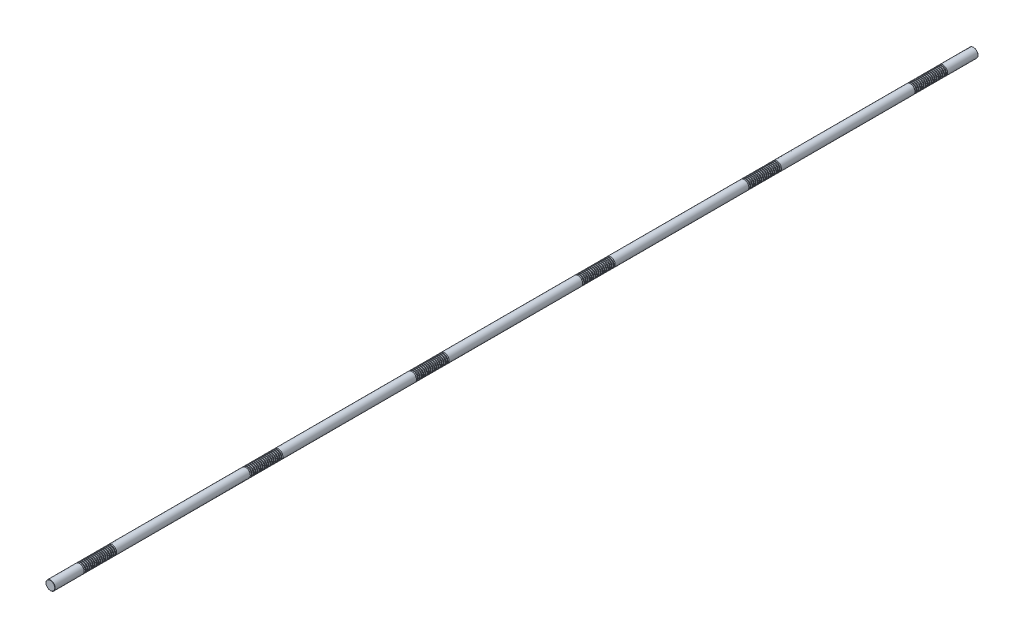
from build123d import *

# Parameters (mm, degrees)
SKETCH1_R           = 15
BOSS_EXTRUDE1_DEPTH = 1500
CHAMFER1_SIZE       = 0.75
LPATTERN1_COUNT     = 18
LPATTERN1_PITCH     = 6
LPATTERN2_COUNT     = 6
LPATTERN2_PITCH     = 540


with BuildPart() as part:
    # Sketch1 → Boss-Extrude1 (new, symmetric)
    with BuildSketch(Plane.XY):
        Circle(SKETCH1_R)
    extrude(amount=BOSS_EXTRUDE1_DEPTH, both=True)

    # Chamfer1
    chamfer1_edges = [part.edges().sort_by_distance(p)[0] for p in [
        (-15, 0, -1500),
        (-15, 0, 1500),
    ]]
    chamfer(chamfer1_edges, length=CHAMFER1_SIZE)

    # Sketch2 → Cut-Revolve1 (revolve, cut)
    with BuildSketch(Plane(origin=(0, 0, 0), x_dir=(0, 0, -1), z_dir=(1, 0, 0)), mode=Mode.PRIVATE) as cut_revolve1_sk:
        Polygon((1400.468911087, 15), (1396.531088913, 15), (1397.468911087, 11.5), (1399.531088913, 11.5), align=None)
    cut_revolve1 = revolve(cut_revolve1_sk.sketch.rotate(Axis((0, 0, 1500), (0, 0, -1)), 90), axis=Axis((0, 0, 1500), (0, 0, -1)), mode=Mode.SUBTRACT)

    # LPattern1: Cut-Revolve1 ×18
    with Locations(*[(0, 0, i * LPATTERN1_PITCH) for i in range(1, LPATTERN1_COUNT)]):
        add(cut_revolve1, mode=Mode.SUBTRACT)

    # LPattern2: Cut-Revolve1 ×6
    with Locations(*[(0, 0, i * LPATTERN2_PITCH) for i in range(1, LPATTERN2_COUNT)]):
        add(cut_revolve1, mode=Mode.SUBTRACT)

    # LPattern2 copy 1 sketch → LPattern2 copy 1 (revolve, cut)
    with BuildSketch(Plane(origin=(0, 0, 546), x_dir=(0, 0, -1), z_dir=(1, 0, 0))):
        Polygon((1400.468911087, 15), (1396.531088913, 15), (1397.468911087, 11.5), (1399.531088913, 11.5), align=None)
    revolve(axis=Axis((0, 0, 2046), (0, 0, -1)), mode=Mode.SUBTRACT)

    # LPattern2 copy 2 sketch → LPattern2 copy 2 (revolve, cut)
    with BuildSketch(Plane(origin=(0, 0, 1086), x_dir=(0, 0, -1), z_dir=(1, 0, 0))):
        Polygon((1400.468911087, 15), (1396.531088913, 15), (1397.468911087, 11.5), (1399.531088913, 11.5), align=None)
    revolve(axis=Axis((0, 0, 2586), (0, 0, -1)), mode=Mode.SUBTRACT)

    # LPattern2 copy 3 sketch → LPattern2 copy 3 (revolve, cut)
    with BuildSketch(Plane(origin=(0, 0, 1626), x_dir=(0, 0, -1), z_dir=(1, 0, 0))):
        Polygon((1400.468911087, 15), (1396.531088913, 15), (1397.468911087, 11.5), (1399.531088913, 11.5), align=None)
    revolve(axis=Axis((0, 0, 3126), (0, 0, -1)), mode=Mode.SUBTRACT)

    # LPattern2 copy 4 sketch → LPattern2 copy 4 (revolve, cut)
    with BuildSketch(Plane(origin=(0, 0, 2166), x_dir=(0, 0, -1), z_dir=(1, 0, 0))):
        Polygon((1400.468911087, 15), (1396.531088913, 15), (1397.468911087, 11.5), (1399.531088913, 11.5), align=None)
    revolve(axis=Axis((0, 0, 3666), (0, 0, -1)), mode=Mode.SUBTRACT)

    # LPattern2 copy 5 sketch → LPattern2 copy 5 (revolve, cut)
    with BuildSketch(Plane(origin=(0, 0, 2706), x_dir=(0, 0, -1), z_dir=(1, 0, 0))):
        Polygon((1400.468911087, 15), (1396.531088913, 15), (1397.468911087, 11.5), (1399.531088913, 11.5), align=None)
    revolve(axis=Axis((0, 0, 4206), (0, 0, -1)), mode=Mode.SUBTRACT)

    # LPattern2 copy 6 sketch → LPattern2 copy 6 (revolve, cut)
    with BuildSketch(Plane(origin=(0, 0, 552), x_dir=(0, 0, -1), z_dir=(1, 0, 0))):
        Polygon((1400.468911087, 15), (1396.531088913, 15), (1397.468911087, 11.5), (1399.531088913, 11.5), align=None)
    revolve(axis=Axis((0, 0, 2052), (0, 0, -1)), mode=Mode.SUBTRACT)

    # LPattern2 copy 7 sketch → LPattern2 copy 7 (revolve, cut)
    with BuildSketch(Plane(origin=(0, 0, 1092), x_dir=(0, 0, -1), z_dir=(1, 0, 0))):
        Polygon((1400.468911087, 15), (1396.531088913, 15), (1397.468911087, 11.5), (1399.531088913, 11.5), align=None)
    revolve(axis=Axis((0, 0, 2592), (0, 0, -1)), mode=Mode.SUBTRACT)

    # LPattern2 copy 8 sketch → LPattern2 copy 8 (revolve, cut)
    with BuildSketch(Plane(origin=(0, 0, 1632), x_dir=(0, 0, -1), z_dir=(1, 0, 0))):
        Polygon((1400.468911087, 15), (1396.531088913, 15), (1397.468911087, 11.5), (1399.531088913, 11.5), align=None)
    revolve(axis=Axis((0, 0, 3132), (0, 0, -1)), mode=Mode.SUBTRACT)

    # LPattern2 copy 9 sketch → LPattern2 copy 9 (revolve, cut)
    with BuildSketch(Plane(origin=(0, 0, 2172), x_dir=(0, 0, -1), z_dir=(1, 0, 0))):
        Polygon((1400.468911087, 15), (1396.531088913, 15), (1397.468911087, 11.5), (1399.531088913, 11.5), align=None)
    revolve(axis=Axis((0, 0, 3672), (0, 0, -1)), mode=Mode.SUBTRACT)

    # LPattern2 copy 10 sketch → LPattern2 copy 10 (revolve, cut)
    with BuildSketch(Plane(origin=(0, 0, 2712), x_dir=(0, 0, -1), z_dir=(1, 0, 0))):
        Polygon((1400.468911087, 15), (1396.531088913, 15), (1397.468911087, 11.5), (1399.531088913, 11.5), align=None)
    revolve(axis=Axis((0, 0, 4212), (0, 0, -1)), mode=Mode.SUBTRACT)

    # LPattern2 copy 11 sketch → LPattern2 copy 11 (revolve, cut)
    with BuildSketch(Plane(origin=(0, 0, 558), x_dir=(0, 0, -1), z_dir=(1, 0, 0))):
        Polygon((1400.468911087, 15), (1396.531088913, 15), (1397.468911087, 11.5), (1399.531088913, 11.5), align=None)
    revolve(axis=Axis((0, 0, 2058), (0, 0, -1)), mode=Mode.SUBTRACT)

    # LPattern2 copy 12 sketch → LPattern2 copy 12 (revolve, cut)
    with BuildSketch(Plane(origin=(0, 0, 1098), x_dir=(0, 0, -1), z_dir=(1, 0, 0))):
        Polygon((1400.468911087, 15), (1396.531088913, 15), (1397.468911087, 11.5), (1399.531088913, 11.5), align=None)
    revolve(axis=Axis((0, 0, 2598), (0, 0, -1)), mode=Mode.SUBTRACT)

    # LPattern2 copy 13 sketch → LPattern2 copy 13 (revolve, cut)
    with BuildSketch(Plane(origin=(0, 0, 1638), x_dir=(0, 0, -1), z_dir=(1, 0, 0))):
        Polygon((1400.468911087, 15), (1396.531088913, 15), (1397.468911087, 11.5), (1399.531088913, 11.5), align=None)
    revolve(axis=Axis((0, 0, 3138), (0, 0, -1)), mode=Mode.SUBTRACT)

    # LPattern2 copy 14 sketch → LPattern2 copy 14 (revolve, cut)
    with BuildSketch(Plane(origin=(0, 0, 2178), x_dir=(0, 0, -1), z_dir=(1, 0, 0))):
        Polygon((1400.468911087, 15), (1396.531088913, 15), (1397.468911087, 11.5), (1399.531088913, 11.5), align=None)
    revolve(axis=Axis((0, 0, 3678), (0, 0, -1)), mode=Mode.SUBTRACT)

    # LPattern2 copy 15 sketch → LPattern2 copy 15 (revolve, cut)
    with BuildSketch(Plane(origin=(0, 0, 2718), x_dir=(0, 0, -1), z_dir=(1, 0, 0))):
        Polygon((1400.468911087, 15), (1396.531088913, 15), (1397.468911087, 11.5), (1399.531088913, 11.5), align=None)
    revolve(axis=Axis((0, 0, 4218), (0, 0, -1)), mode=Mode.SUBTRACT)

    # LPattern2 copy 16 sketch → LPattern2 copy 16 (revolve, cut)
    with BuildSketch(Plane(origin=(0, 0, 564), x_dir=(0, 0, -1), z_dir=(1, 0, 0))):
        Polygon((1400.468911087, 15), (1396.531088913, 15), (1397.468911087, 11.5), (1399.531088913, 11.5), align=None)
    revolve(axis=Axis((0, 0, 2064), (0, 0, -1)), mode=Mode.SUBTRACT)

    # LPattern2 copy 17 sketch → LPattern2 copy 17 (revolve, cut)
    with BuildSketch(Plane(origin=(0, 0, 1104), x_dir=(0, 0, -1), z_dir=(1, 0, 0))):
        Polygon((1400.468911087, 15), (1396.531088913, 15), (1397.468911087, 11.5), (1399.531088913, 11.5), align=None)
    revolve(axis=Axis((0, 0, 2604), (0, 0, -1)), mode=Mode.SUBTRACT)

    # LPattern2 copy 18 sketch → LPattern2 copy 18 (revolve, cut)
    with BuildSketch(Plane(origin=(0, 0, 1644), x_dir=(0, 0, -1), z_dir=(1, 0, 0))):
        Polygon((1400.468911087, 15), (1396.531088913, 15), (1397.468911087, 11.5), (1399.531088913, 11.5), align=None)
    revolve(axis=Axis((0, 0, 3144), (0, 0, -1)), mode=Mode.SUBTRACT)

    # LPattern2 copy 19 sketch → LPattern2 copy 19 (revolve, cut)
    with BuildSketch(Plane(origin=(0, 0, 2184), x_dir=(0, 0, -1), z_dir=(1, 0, 0))):
        Polygon((1400.468911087, 15), (1396.531088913, 15), (1397.468911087, 11.5), (1399.531088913, 11.5), align=None)
    revolve(axis=Axis((0, 0, 3684), (0, 0, -1)), mode=Mode.SUBTRACT)

    # LPattern2 copy 20 sketch → LPattern2 copy 20 (revolve, cut)
    with BuildSketch(Plane(origin=(0, 0, 2724), x_dir=(0, 0, -1), z_dir=(1, 0, 0))):
        Polygon((1400.468911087, 15), (1396.531088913, 15), (1397.468911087, 11.5), (1399.531088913, 11.5), align=None)
    revolve(axis=Axis((0, 0, 4224), (0, 0, -1)), mode=Mode.SUBTRACT)

    # LPattern2 copy 21 sketch → LPattern2 copy 21 (revolve, cut)
    with BuildSketch(Plane(origin=(0, 0, 570), x_dir=(0, 0, -1), z_dir=(1, 0, 0))):
        Polygon((1400.468911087, 15), (1396.531088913, 15), (1397.468911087, 11.5), (1399.531088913, 11.5), align=None)
    revolve(axis=Axis((0, 0, 2070), (0, 0, -1)), mode=Mode.SUBTRACT)

    # LPattern2 copy 22 sketch → LPattern2 copy 22 (revolve, cut)
    with BuildSketch(Plane(origin=(0, 0, 1110), x_dir=(0, 0, -1), z_dir=(1, 0, 0))):
        Polygon((1400.468911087, 15), (1396.531088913, 15), (1397.468911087, 11.5), (1399.531088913, 11.5), align=None)
    revolve(axis=Axis((0, 0, 2610), (0, 0, -1)), mode=Mode.SUBTRACT)

    # LPattern2 copy 23 sketch → LPattern2 copy 23 (revolve, cut)
    with BuildSketch(Plane(origin=(0, 0, 1650), x_dir=(0, 0, -1), z_dir=(1, 0, 0))):
        Polygon((1400.468911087, 15), (1396.531088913, 15), (1397.468911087, 11.5), (1399.531088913, 11.5), align=None)
    revolve(axis=Axis((0, 0, 3150), (0, 0, -1)), mode=Mode.SUBTRACT)

    # LPattern2 copy 24 sketch → LPattern2 copy 24 (revolve, cut)
    with BuildSketch(Plane(origin=(0, 0, 2190), x_dir=(0, 0, -1), z_dir=(1, 0, 0))):
        Polygon((1400.468911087, 15), (1396.531088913, 15), (1397.468911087, 11.5), (1399.531088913, 11.5), align=None)
    revolve(axis=Axis((0, 0, 3690), (0, 0, -1)), mode=Mode.SUBTRACT)

    # LPattern2 copy 25 sketch → LPattern2 copy 25 (revolve, cut)
    with BuildSketch(Plane(origin=(0, 0, 2730), x_dir=(0, 0, -1), z_dir=(1, 0, 0))):
        Polygon((1400.468911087, 15), (1396.531088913, 15), (1397.468911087, 11.5), (1399.531088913, 11.5), align=None)
    revolve(axis=Axis((0, 0, 4230), (0, 0, -1)), mode=Mode.SUBTRACT)

    # LPattern2 copy 26 sketch → LPattern2 copy 26 (revolve, cut)
    with BuildSketch(Plane(origin=(0, 0, 576), x_dir=(0, 0, -1), z_dir=(1, 0, 0))):
        Polygon((1400.468911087, 15), (1396.531088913, 15), (1397.468911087, 11.5), (1399.531088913, 11.5), align=None)
    revolve(axis=Axis((0, 0, 2076), (0, 0, -1)), mode=Mode.SUBTRACT)

    # LPattern2 copy 27 sketch → LPattern2 copy 27 (revolve, cut)
    with BuildSketch(Plane(origin=(0, 0, 1116), x_dir=(0, 0, -1), z_dir=(1, 0, 0))):
        Polygon((1400.468911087, 15), (1396.531088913, 15), (1397.468911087, 11.5), (1399.531088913, 11.5), align=None)
    revolve(axis=Axis((0, 0, 2616), (0, 0, -1)), mode=Mode.SUBTRACT)

    # LPattern2 copy 28 sketch → LPattern2 copy 28 (revolve, cut)
    with BuildSketch(Plane(origin=(0, 0, 1656), x_dir=(0, 0, -1), z_dir=(1, 0, 0))):
        Polygon((1400.468911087, 15), (1396.531088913, 15), (1397.468911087, 11.5), (1399.531088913, 11.5), align=None)
    revolve(axis=Axis((0, 0, 3156), (0, 0, -1)), mode=Mode.SUBTRACT)

    # LPattern2 copy 29 sketch → LPattern2 copy 29 (revolve, cut)
    with BuildSketch(Plane(origin=(0, 0, 2196), x_dir=(0, 0, -1), z_dir=(1, 0, 0))):
        Polygon((1400.468911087, 15), (1396.531088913, 15), (1397.468911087, 11.5), (1399.531088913, 11.5), align=None)
    revolve(axis=Axis((0, 0, 3696), (0, 0, -1)), mode=Mode.SUBTRACT)

    # LPattern2 copy 30 sketch → LPattern2 copy 30 (revolve, cut)
    with BuildSketch(Plane(origin=(0, 0, 2736), x_dir=(0, 0, -1), z_dir=(1, 0, 0))):
        Polygon((1400.468911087, 15), (1396.531088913, 15), (1397.468911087, 11.5), (1399.531088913, 11.5), align=None)
    revolve(axis=Axis((0, 0, 4236), (0, 0, -1)), mode=Mode.SUBTRACT)

    # LPattern2 copy 31 sketch → LPattern2 copy 31 (revolve, cut)
    with BuildSketch(Plane(origin=(0, 0, 582), x_dir=(0, 0, -1), z_dir=(1, 0, 0))):
        Polygon((1400.468911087, 15), (1396.531088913, 15), (1397.468911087, 11.5), (1399.531088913, 11.5), align=None)
    revolve(axis=Axis((0, 0, 2082), (0, 0, -1)), mode=Mode.SUBTRACT)

    # LPattern2 copy 32 sketch → LPattern2 copy 32 (revolve, cut)
    with BuildSketch(Plane(origin=(0, 0, 1122), x_dir=(0, 0, -1), z_dir=(1, 0, 0))):
        Polygon((1400.468911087, 15), (1396.531088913, 15), (1397.468911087, 11.5), (1399.531088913, 11.5), align=None)
    revolve(axis=Axis((0, 0, 2622), (0, 0, -1)), mode=Mode.SUBTRACT)

    # LPattern2 copy 33 sketch → LPattern2 copy 33 (revolve, cut)
    with BuildSketch(Plane(origin=(0, 0, 1662), x_dir=(0, 0, -1), z_dir=(1, 0, 0))):
        Polygon((1400.468911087, 15), (1396.531088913, 15), (1397.468911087, 11.5), (1399.531088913, 11.5), align=None)
    revolve(axis=Axis((0, 0, 3162), (0, 0, -1)), mode=Mode.SUBTRACT)

    # LPattern2 copy 34 sketch → LPattern2 copy 34 (revolve, cut)
    with BuildSketch(Plane(origin=(0, 0, 2202), x_dir=(0, 0, -1), z_dir=(1, 0, 0))):
        Polygon((1400.468911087, 15), (1396.531088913, 15), (1397.468911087, 11.5), (1399.531088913, 11.5), align=None)
    revolve(axis=Axis((0, 0, 3702), (0, 0, -1)), mode=Mode.SUBTRACT)

    # LPattern2 copy 35 sketch → LPattern2 copy 35 (revolve, cut)
    with BuildSketch(Plane(origin=(0, 0, 2742), x_dir=(0, 0, -1), z_dir=(1, 0, 0))):
        Polygon((1400.468911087, 15), (1396.531088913, 15), (1397.468911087, 11.5), (1399.531088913, 11.5), align=None)
    revolve(axis=Axis((0, 0, 4242), (0, 0, -1)), mode=Mode.SUBTRACT)

    # LPattern2 copy 36 sketch → LPattern2 copy 36 (revolve, cut)
    with BuildSketch(Plane(origin=(0, 0, 588), x_dir=(0, 0, -1), z_dir=(1, 0, 0))):
        Polygon((1400.468911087, 15), (1396.531088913, 15), (1397.468911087, 11.5), (1399.531088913, 11.5), align=None)
    revolve(axis=Axis((0, 0, 2088), (0, 0, -1)), mode=Mode.SUBTRACT)

    # LPattern2 copy 37 sketch → LPattern2 copy 37 (revolve, cut)
    with BuildSketch(Plane(origin=(0, 0, 1128), x_dir=(0, 0, -1), z_dir=(1, 0, 0))):
        Polygon((1400.468911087, 15), (1396.531088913, 15), (1397.468911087, 11.5), (1399.531088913, 11.5), align=None)
    revolve(axis=Axis((0, 0, 2628), (0, 0, -1)), mode=Mode.SUBTRACT)

    # LPattern2 copy 38 sketch → LPattern2 copy 38 (revolve, cut)
    with BuildSketch(Plane(origin=(0, 0, 1668), x_dir=(0, 0, -1), z_dir=(1, 0, 0))):
        Polygon((1400.468911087, 15), (1396.531088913, 15), (1397.468911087, 11.5), (1399.531088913, 11.5), align=None)
    revolve(axis=Axis((0, 0, 3168), (0, 0, -1)), mode=Mode.SUBTRACT)

    # LPattern2 copy 39 sketch → LPattern2 copy 39 (revolve, cut)
    with BuildSketch(Plane(origin=(0, 0, 2208), x_dir=(0, 0, -1), z_dir=(1, 0, 0))):
        Polygon((1400.468911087, 15), (1396.531088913, 15), (1397.468911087, 11.5), (1399.531088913, 11.5), align=None)
    revolve(axis=Axis((0, 0, 3708), (0, 0, -1)), mode=Mode.SUBTRACT)

    # LPattern2 copy 40 sketch → LPattern2 copy 40 (revolve, cut)
    with BuildSketch(Plane(origin=(0, 0, 2748), x_dir=(0, 0, -1), z_dir=(1, 0, 0))):
        Polygon((1400.468911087, 15), (1396.531088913, 15), (1397.468911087, 11.5), (1399.531088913, 11.5), align=None)
    revolve(axis=Axis((0, 0, 4248), (0, 0, -1)), mode=Mode.SUBTRACT)

    # LPattern2 copy 41 sketch → LPattern2 copy 41 (revolve, cut)
    with BuildSketch(Plane(origin=(0, 0, 594), x_dir=(0, 0, -1), z_dir=(1, 0, 0))):
        Polygon((1400.468911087, 15), (1396.531088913, 15), (1397.468911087, 11.5), (1399.531088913, 11.5), align=None)
    revolve(axis=Axis((0, 0, 2094), (0, 0, -1)), mode=Mode.SUBTRACT)

    # LPattern2 copy 42 sketch → LPattern2 copy 42 (revolve, cut)
    with BuildSketch(Plane(origin=(0, 0, 1134), x_dir=(0, 0, -1), z_dir=(1, 0, 0))):
        Polygon((1400.468911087, 15), (1396.531088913, 15), (1397.468911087, 11.5), (1399.531088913, 11.5), align=None)
    revolve(axis=Axis((0, 0, 2634), (0, 0, -1)), mode=Mode.SUBTRACT)

    # LPattern2 copy 43 sketch → LPattern2 copy 43 (revolve, cut)
    with BuildSketch(Plane(origin=(0, 0, 1674), x_dir=(0, 0, -1), z_dir=(1, 0, 0))):
        Polygon((1400.468911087, 15), (1396.531088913, 15), (1397.468911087, 11.5), (1399.531088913, 11.5), align=None)
    revolve(axis=Axis((0, 0, 3174), (0, 0, -1)), mode=Mode.SUBTRACT)

    # LPattern2 copy 44 sketch → LPattern2 copy 44 (revolve, cut)
    with BuildSketch(Plane(origin=(0, 0, 2214), x_dir=(0, 0, -1), z_dir=(1, 0, 0))):
        Polygon((1400.468911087, 15), (1396.531088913, 15), (1397.468911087, 11.5), (1399.531088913, 11.5), align=None)
    revolve(axis=Axis((0, 0, 3714), (0, 0, -1)), mode=Mode.SUBTRACT)

    # LPattern2 copy 45 sketch → LPattern2 copy 45 (revolve, cut)
    with BuildSketch(Plane(origin=(0, 0, 2754), x_dir=(0, 0, -1), z_dir=(1, 0, 0))):
        Polygon((1400.468911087, 15), (1396.531088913, 15), (1397.468911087, 11.5), (1399.531088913, 11.5), align=None)
    revolve(axis=Axis((0, 0, 4254), (0, 0, -1)), mode=Mode.SUBTRACT)

    # LPattern2 copy 46 sketch → LPattern2 copy 46 (revolve, cut)
    with BuildSketch(Plane(origin=(0, 0, 600), x_dir=(0, 0, -1), z_dir=(1, 0, 0))):
        Polygon((1400.468911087, 15), (1396.531088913, 15), (1397.468911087, 11.5), (1399.531088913, 11.5), align=None)
    revolve(axis=Axis((0, 0, 2100), (0, 0, -1)), mode=Mode.SUBTRACT)

    # LPattern2 copy 47 sketch → LPattern2 copy 47 (revolve, cut)
    with BuildSketch(Plane(origin=(0, 0, 1140), x_dir=(0, 0, -1), z_dir=(1, 0, 0))):
        Polygon((1400.468911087, 15), (1396.531088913, 15), (1397.468911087, 11.5), (1399.531088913, 11.5), align=None)
    revolve(axis=Axis((0, 0, 2640), (0, 0, -1)), mode=Mode.SUBTRACT)

    # LPattern2 copy 48 sketch → LPattern2 copy 48 (revolve, cut)
    with BuildSketch(Plane(origin=(0, 0, 1680), x_dir=(0, 0, -1), z_dir=(1, 0, 0))):
        Polygon((1400.468911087, 15), (1396.531088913, 15), (1397.468911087, 11.5), (1399.531088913, 11.5), align=None)
    revolve(axis=Axis((0, 0, 3180), (0, 0, -1)), mode=Mode.SUBTRACT)

    # LPattern2 copy 49 sketch → LPattern2 copy 49 (revolve, cut)
    with BuildSketch(Plane(origin=(0, 0, 2220), x_dir=(0, 0, -1), z_dir=(1, 0, 0))):
        Polygon((1400.468911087, 15), (1396.531088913, 15), (1397.468911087, 11.5), (1399.531088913, 11.5), align=None)
    revolve(axis=Axis((0, 0, 3720), (0, 0, -1)), mode=Mode.SUBTRACT)

    # LPattern2 copy 50 sketch → LPattern2 copy 50 (revolve, cut)
    with BuildSketch(Plane(origin=(0, 0, 2760), x_dir=(0, 0, -1), z_dir=(1, 0, 0))):
        Polygon((1400.468911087, 15), (1396.531088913, 15), (1397.468911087, 11.5), (1399.531088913, 11.5), align=None)
    revolve(axis=Axis((0, 0, 4260), (0, 0, -1)), mode=Mode.SUBTRACT)

    # LPattern2 copy 51 sketch → LPattern2 copy 51 (revolve, cut)
    with BuildSketch(Plane(origin=(0, 0, 606), x_dir=(0, 0, -1), z_dir=(1, 0, 0))):
        Polygon((1400.468911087, 15), (1396.531088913, 15), (1397.468911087, 11.5), (1399.531088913, 11.5), align=None)
    revolve(axis=Axis((0, 0, 2106), (0, 0, -1)), mode=Mode.SUBTRACT)

    # LPattern2 copy 52 sketch → LPattern2 copy 52 (revolve, cut)
    with BuildSketch(Plane(origin=(0, 0, 1146), x_dir=(0, 0, -1), z_dir=(1, 0, 0))):
        Polygon((1400.468911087, 15), (1396.531088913, 15), (1397.468911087, 11.5), (1399.531088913, 11.5), align=None)
    revolve(axis=Axis((0, 0, 2646), (0, 0, -1)), mode=Mode.SUBTRACT)

    # LPattern2 copy 53 sketch → LPattern2 copy 53 (revolve, cut)
    with BuildSketch(Plane(origin=(0, 0, 1686), x_dir=(0, 0, -1), z_dir=(1, 0, 0))):
        Polygon((1400.468911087, 15), (1396.531088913, 15), (1397.468911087, 11.5), (1399.531088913, 11.5), align=None)
    revolve(axis=Axis((0, 0, 3186), (0, 0, -1)), mode=Mode.SUBTRACT)

    # LPattern2 copy 54 sketch → LPattern2 copy 54 (revolve, cut)
    with BuildSketch(Plane(origin=(0, 0, 2226), x_dir=(0, 0, -1), z_dir=(1, 0, 0))):
        Polygon((1400.468911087, 15), (1396.531088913, 15), (1397.468911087, 11.5), (1399.531088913, 11.5), align=None)
    revolve(axis=Axis((0, 0, 3726), (0, 0, -1)), mode=Mode.SUBTRACT)

    # LPattern2 copy 55 sketch → LPattern2 copy 55 (revolve, cut)
    with BuildSketch(Plane(origin=(0, 0, 2766), x_dir=(0, 0, -1), z_dir=(1, 0, 0))):
        Polygon((1400.468911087, 15), (1396.531088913, 15), (1397.468911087, 11.5), (1399.531088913, 11.5), align=None)
    revolve(axis=Axis((0, 0, 4266), (0, 0, -1)), mode=Mode.SUBTRACT)

    # LPattern2 copy 56 sketch → LPattern2 copy 56 (revolve, cut)
    with BuildSketch(Plane(origin=(0, 0, 612), x_dir=(0, 0, -1), z_dir=(1, 0, 0))):
        Polygon((1400.468911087, 15), (1396.531088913, 15), (1397.468911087, 11.5), (1399.531088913, 11.5), align=None)
    revolve(axis=Axis((0, 0, 2112), (0, 0, -1)), mode=Mode.SUBTRACT)

    # LPattern2 copy 57 sketch → LPattern2 copy 57 (revolve, cut)
    with BuildSketch(Plane(origin=(0, 0, 1152), x_dir=(0, 0, -1), z_dir=(1, 0, 0))):
        Polygon((1400.468911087, 15), (1396.531088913, 15), (1397.468911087, 11.5), (1399.531088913, 11.5), align=None)
    revolve(axis=Axis((0, 0, 2652), (0, 0, -1)), mode=Mode.SUBTRACT)

    # LPattern2 copy 58 sketch → LPattern2 copy 58 (revolve, cut)
    with BuildSketch(Plane(origin=(0, 0, 1692), x_dir=(0, 0, -1), z_dir=(1, 0, 0))):
        Polygon((1400.468911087, 15), (1396.531088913, 15), (1397.468911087, 11.5), (1399.531088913, 11.5), align=None)
    revolve(axis=Axis((0, 0, 3192), (0, 0, -1)), mode=Mode.SUBTRACT)

    # LPattern2 copy 59 sketch → LPattern2 copy 59 (revolve, cut)
    with BuildSketch(Plane(origin=(0, 0, 2232), x_dir=(0, 0, -1), z_dir=(1, 0, 0))):
        Polygon((1400.468911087, 15), (1396.531088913, 15), (1397.468911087, 11.5), (1399.531088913, 11.5), align=None)
    revolve(axis=Axis((0, 0, 3732), (0, 0, -1)), mode=Mode.SUBTRACT)

    # LPattern2 copy 60 sketch → LPattern2 copy 60 (revolve, cut)
    with BuildSketch(Plane(origin=(0, 0, 2772), x_dir=(0, 0, -1), z_dir=(1, 0, 0))):
        Polygon((1400.468911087, 15), (1396.531088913, 15), (1397.468911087, 11.5), (1399.531088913, 11.5), align=None)
    revolve(axis=Axis((0, 0, 4272), (0, 0, -1)), mode=Mode.SUBTRACT)

    # LPattern2 copy 61 sketch → LPattern2 copy 61 (revolve, cut)
    with BuildSketch(Plane(origin=(0, 0, 618), x_dir=(0, 0, -1), z_dir=(1, 0, 0))):
        Polygon((1400.468911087, 15), (1396.531088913, 15), (1397.468911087, 11.5), (1399.531088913, 11.5), align=None)
    revolve(axis=Axis((0, 0, 2118), (0, 0, -1)), mode=Mode.SUBTRACT)

    # LPattern2 copy 62 sketch → LPattern2 copy 62 (revolve, cut)
    with BuildSketch(Plane(origin=(0, 0, 1158), x_dir=(0, 0, -1), z_dir=(1, 0, 0))):
        Polygon((1400.468911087, 15), (1396.531088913, 15), (1397.468911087, 11.5), (1399.531088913, 11.5), align=None)
    revolve(axis=Axis((0, 0, 2658), (0, 0, -1)), mode=Mode.SUBTRACT)

    # LPattern2 copy 63 sketch → LPattern2 copy 63 (revolve, cut)
    with BuildSketch(Plane(origin=(0, 0, 1698), x_dir=(0, 0, -1), z_dir=(1, 0, 0))):
        Polygon((1400.468911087, 15), (1396.531088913, 15), (1397.468911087, 11.5), (1399.531088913, 11.5), align=None)
    revolve(axis=Axis((0, 0, 3198), (0, 0, -1)), mode=Mode.SUBTRACT)

    # LPattern2 copy 64 sketch → LPattern2 copy 64 (revolve, cut)
    with BuildSketch(Plane(origin=(0, 0, 2238), x_dir=(0, 0, -1), z_dir=(1, 0, 0))):
        Polygon((1400.468911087, 15), (1396.531088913, 15), (1397.468911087, 11.5), (1399.531088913, 11.5), align=None)
    revolve(axis=Axis((0, 0, 3738), (0, 0, -1)), mode=Mode.SUBTRACT)

    # LPattern2 copy 65 sketch → LPattern2 copy 65 (revolve, cut)
    with BuildSketch(Plane(origin=(0, 0, 2778), x_dir=(0, 0, -1), z_dir=(1, 0, 0))):
        Polygon((1400.468911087, 15), (1396.531088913, 15), (1397.468911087, 11.5), (1399.531088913, 11.5), align=None)
    revolve(axis=Axis((0, 0, 4278), (0, 0, -1)), mode=Mode.SUBTRACT)

    # LPattern2 copy 66 sketch → LPattern2 copy 66 (revolve, cut)
    with BuildSketch(Plane(origin=(0, 0, 624), x_dir=(0, 0, -1), z_dir=(1, 0, 0))):
        Polygon((1400.468911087, 15), (1396.531088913, 15), (1397.468911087, 11.5), (1399.531088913, 11.5), align=None)
    revolve(axis=Axis((0, 0, 2124), (0, 0, -1)), mode=Mode.SUBTRACT)

    # LPattern2 copy 67 sketch → LPattern2 copy 67 (revolve, cut)
    with BuildSketch(Plane(origin=(0, 0, 1164), x_dir=(0, 0, -1), z_dir=(1, 0, 0))):
        Polygon((1400.468911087, 15), (1396.531088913, 15), (1397.468911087, 11.5), (1399.531088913, 11.5), align=None)
    revolve(axis=Axis((0, 0, 2664), (0, 0, -1)), mode=Mode.SUBTRACT)

    # LPattern2 copy 68 sketch → LPattern2 copy 68 (revolve, cut)
    with BuildSketch(Plane(origin=(0, 0, 1704), x_dir=(0, 0, -1), z_dir=(1, 0, 0))):
        Polygon((1400.468911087, 15), (1396.531088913, 15), (1397.468911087, 11.5), (1399.531088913, 11.5), align=None)
    revolve(axis=Axis((0, 0, 3204), (0, 0, -1)), mode=Mode.SUBTRACT)

    # LPattern2 copy 69 sketch → LPattern2 copy 69 (revolve, cut)
    with BuildSketch(Plane(origin=(0, 0, 2244), x_dir=(0, 0, -1), z_dir=(1, 0, 0))):
        Polygon((1400.468911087, 15), (1396.531088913, 15), (1397.468911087, 11.5), (1399.531088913, 11.5), align=None)
    revolve(axis=Axis((0, 0, 3744), (0, 0, -1)), mode=Mode.SUBTRACT)

    # LPattern2 copy 70 sketch → LPattern2 copy 70 (revolve, cut)
    with BuildSketch(Plane(origin=(0, 0, 2784), x_dir=(0, 0, -1), z_dir=(1, 0, 0))):
        Polygon((1400.468911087, 15), (1396.531088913, 15), (1397.468911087, 11.5), (1399.531088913, 11.5), align=None)
    revolve(axis=Axis((0, 0, 4284), (0, 0, -1)), mode=Mode.SUBTRACT)

    # LPattern2 copy 71 sketch → LPattern2 copy 71 (revolve, cut)
    with BuildSketch(Plane(origin=(0, 0, 630), x_dir=(0, 0, -1), z_dir=(1, 0, 0))):
        Polygon((1400.468911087, 15), (1396.531088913, 15), (1397.468911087, 11.5), (1399.531088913, 11.5), align=None)
    revolve(axis=Axis((0, 0, 2130), (0, 0, -1)), mode=Mode.SUBTRACT)

    # LPattern2 copy 72 sketch → LPattern2 copy 72 (revolve, cut)
    with BuildSketch(Plane(origin=(0, 0, 1170), x_dir=(0, 0, -1), z_dir=(1, 0, 0))):
        Polygon((1400.468911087, 15), (1396.531088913, 15), (1397.468911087, 11.5), (1399.531088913, 11.5), align=None)
    revolve(axis=Axis((0, 0, 2670), (0, 0, -1)), mode=Mode.SUBTRACT)

    # LPattern2 copy 73 sketch → LPattern2 copy 73 (revolve, cut)
    with BuildSketch(Plane(origin=(0, 0, 1710), x_dir=(0, 0, -1), z_dir=(1, 0, 0))):
        Polygon((1400.468911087, 15), (1396.531088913, 15), (1397.468911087, 11.5), (1399.531088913, 11.5), align=None)
    revolve(axis=Axis((0, 0, 3210), (0, 0, -1)), mode=Mode.SUBTRACT)

    # LPattern2 copy 74 sketch → LPattern2 copy 74 (revolve, cut)
    with BuildSketch(Plane(origin=(0, 0, 2250), x_dir=(0, 0, -1), z_dir=(1, 0, 0))):
        Polygon((1400.468911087, 15), (1396.531088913, 15), (1397.468911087, 11.5), (1399.531088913, 11.5), align=None)
    revolve(axis=Axis((0, 0, 3750), (0, 0, -1)), mode=Mode.SUBTRACT)

    # LPattern2 copy 75 sketch → LPattern2 copy 75 (revolve, cut)
    with BuildSketch(Plane(origin=(0, 0, 2790), x_dir=(0, 0, -1), z_dir=(1, 0, 0))):
        Polygon((1400.468911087, 15), (1396.531088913, 15), (1397.468911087, 11.5), (1399.531088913, 11.5), align=None)
    revolve(axis=Axis((0, 0, 4290), (0, 0, -1)), mode=Mode.SUBTRACT)

    # LPattern2 copy 76 sketch → LPattern2 copy 76 (revolve, cut)
    with BuildSketch(Plane(origin=(0, 0, 636), x_dir=(0, 0, -1), z_dir=(1, 0, 0))):
        Polygon((1400.468911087, 15), (1396.531088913, 15), (1397.468911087, 11.5), (1399.531088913, 11.5), align=None)
    revolve(axis=Axis((0, 0, 2136), (0, 0, -1)), mode=Mode.SUBTRACT)

    # LPattern2 copy 77 sketch → LPattern2 copy 77 (revolve, cut)
    with BuildSketch(Plane(origin=(0, 0, 1176), x_dir=(0, 0, -1), z_dir=(1, 0, 0))):
        Polygon((1400.468911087, 15), (1396.531088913, 15), (1397.468911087, 11.5), (1399.531088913, 11.5), align=None)
    revolve(axis=Axis((0, 0, 2676), (0, 0, -1)), mode=Mode.SUBTRACT)

    # LPattern2 copy 78 sketch → LPattern2 copy 78 (revolve, cut)
    with BuildSketch(Plane(origin=(0, 0, 1716), x_dir=(0, 0, -1), z_dir=(1, 0, 0))):
        Polygon((1400.468911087, 15), (1396.531088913, 15), (1397.468911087, 11.5), (1399.531088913, 11.5), align=None)
    revolve(axis=Axis((0, 0, 3216), (0, 0, -1)), mode=Mode.SUBTRACT)

    # LPattern2 copy 79 sketch → LPattern2 copy 79 (revolve, cut)
    with BuildSketch(Plane(origin=(0, 0, 2256), x_dir=(0, 0, -1), z_dir=(1, 0, 0))):
        Polygon((1400.468911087, 15), (1396.531088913, 15), (1397.468911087, 11.5), (1399.531088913, 11.5), align=None)
    revolve(axis=Axis((0, 0, 3756), (0, 0, -1)), mode=Mode.SUBTRACT)

    # LPattern2 copy 80 sketch → LPattern2 copy 80 (revolve, cut)
    with BuildSketch(Plane(origin=(0, 0, 2796), x_dir=(0, 0, -1), z_dir=(1, 0, 0))):
        Polygon((1400.468911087, 15), (1396.531088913, 15), (1397.468911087, 11.5), (1399.531088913, 11.5), align=None)
    revolve(axis=Axis((0, 0, 4296), (0, 0, -1)), mode=Mode.SUBTRACT)

    # LPattern2 copy 81 sketch → LPattern2 copy 81 (revolve, cut)
    with BuildSketch(Plane(origin=(0, 0, 642), x_dir=(0, 0, -1), z_dir=(1, 0, 0))):
        Polygon((1400.468911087, 15), (1396.531088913, 15), (1397.468911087, 11.5), (1399.531088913, 11.5), align=None)
    revolve(axis=Axis((0, 0, 2142), (0, 0, -1)), mode=Mode.SUBTRACT)

    # LPattern2 copy 82 sketch → LPattern2 copy 82 (revolve, cut)
    with BuildSketch(Plane(origin=(0, 0, 1182), x_dir=(0, 0, -1), z_dir=(1, 0, 0))):
        Polygon((1400.468911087, 15), (1396.531088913, 15), (1397.468911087, 11.5), (1399.531088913, 11.5), align=None)
    revolve(axis=Axis((0, 0, 2682), (0, 0, -1)), mode=Mode.SUBTRACT)

    # LPattern2 copy 83 sketch → LPattern2 copy 83 (revolve, cut)
    with BuildSketch(Plane(origin=(0, 0, 1722), x_dir=(0, 0, -1), z_dir=(1, 0, 0))):
        Polygon((1400.468911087, 15), (1396.531088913, 15), (1397.468911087, 11.5), (1399.531088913, 11.5), align=None)
    revolve(axis=Axis((0, 0, 3222), (0, 0, -1)), mode=Mode.SUBTRACT)

    # LPattern2 copy 84 sketch → LPattern2 copy 84 (revolve, cut)
    with BuildSketch(Plane(origin=(0, 0, 2262), x_dir=(0, 0, -1), z_dir=(1, 0, 0))):
        Polygon((1400.468911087, 15), (1396.531088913, 15), (1397.468911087, 11.5), (1399.531088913, 11.5), align=None)
    revolve(axis=Axis((0, 0, 3762), (0, 0, -1)), mode=Mode.SUBTRACT)

    # LPattern2 copy 85 sketch → LPattern2 copy 85 (revolve, cut)
    with BuildSketch(Plane(origin=(0, 0, 2802), x_dir=(0, 0, -1), z_dir=(1, 0, 0))):
        Polygon((1400.468911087, 15), (1396.531088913, 15), (1397.468911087, 11.5), (1399.531088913, 11.5), align=None)
    revolve(axis=Axis((0, 0, 4302), (0, 0, -1)), mode=Mode.SUBTRACT)


solid = part.part
